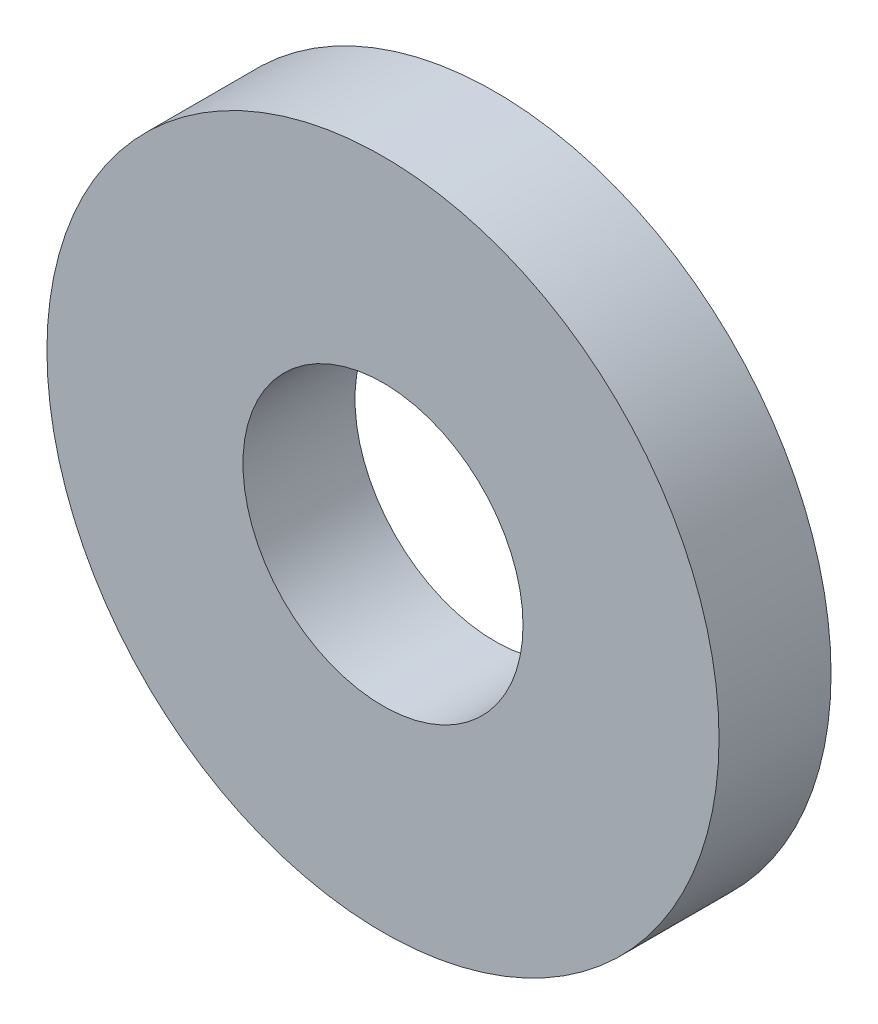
ISO-10303-21;
HEADER;
FILE_DESCRIPTION(('STEP AP214'),'2;1');
FILE_NAME('part.step','',(''),(''),'','','');
FILE_SCHEMA(('AUTOMOTIVE_DESIGN { 1 0 10303 214 1 1 1 1 }'));
ENDSEC;
DATA;
#1=APPLICATION_CONTEXT('core data for automotive mechanical design processes');
#2=APPLICATION_PROTOCOL_DEFINITION('international standard','automotive_design',2000,#1);
#3=PRODUCT_CONTEXT('',#1,'mechanical');
#4=PRODUCT('Part','Part','',(#3));
#5=PRODUCT_RELATED_PRODUCT_CATEGORY('part','',(#4));
#6=PRODUCT_DEFINITION_FORMATION('','',#4);
#7=PRODUCT_DEFINITION_CONTEXT('part definition',#1,'design');
#8=PRODUCT_DEFINITION('design','',#6,#7);
#9=PRODUCT_DEFINITION_SHAPE('','',#8);
#10=(LENGTH_UNIT() NAMED_UNIT(*) SI_UNIT(.MILLI.,.METRE.));
#11=(NAMED_UNIT(*) PLANE_ANGLE_UNIT() SI_UNIT($,.RADIAN.));
#12=(NAMED_UNIT(*) SI_UNIT($,.STERADIAN.) SOLID_ANGLE_UNIT());
#13=UNCERTAINTY_MEASURE_WITH_UNIT(LENGTH_MEASURE(1.E-05),#10,'distance_accuracy_value','');
#14=(GEOMETRIC_REPRESENTATION_CONTEXT(3) GLOBAL_UNCERTAINTY_ASSIGNED_CONTEXT((#13)) GLOBAL_UNIT_ASSIGNED_CONTEXT((#10,
#11,#12)) REPRESENTATION_CONTEXT('',''));
#15=CARTESIAN_POINT('',(0.,0.,0.));
#16=DIRECTION('',(0.,0.,1.));
#17=DIRECTION('',(1.,0.,0.));
#18=AXIS2_PLACEMENT_3D('',#15,#16,#17);
#19=CARTESIAN_POINT('',(-425.1,65.,-54.));
#20=DIRECTION('',(0.,0.,1.));
#21=DIRECTION('',(1.,0.,0.));
#22=AXIS2_PLACEMENT_3D('',#19,#20,#21);
#23=PLANE('',#22);
#24=CARTESIAN_POINT('',(-425.1,65.,-54.));
#25=DIRECTION('',(0.,0.,1.));
#26=DIRECTION('',(1.,0.,0.));
#27=AXIS2_PLACEMENT_3D('',#24,#25,#26);
#28=CIRCLE('',#27,5.);
#29=CARTESIAN_POINT('',(-420.1,65.,-54.));
#30=VERTEX_POINT('',#29);
#31=EDGE_CURVE('E58',#30,#30,#28,.T.);
#32=ORIENTED_EDGE('',*,*,#31,.T.);
#33=EDGE_LOOP('',(#32));
#34=FACE_BOUND('',#33,.T.);
#35=CARTESIAN_POINT('',(-425.1,65.,-54.));
#36=DIRECTION('',(0.,0.,1.));
#37=DIRECTION('',(1.,0.,0.));
#38=AXIS2_PLACEMENT_3D('',#35,#36,#37);
#39=CIRCLE('',#38,12.);
#40=CARTESIAN_POINT('',(-413.1,65.,-54.));
#41=VERTEX_POINT('',#40);
#42=EDGE_CURVE('E50',#41,#41,#39,.T.);
#43=ORIENTED_EDGE('',*,*,#42,.F.);
#44=EDGE_LOOP('',(#43));
#45=FACE_BOUND('',#44,.T.);
#46=ADVANCED_FACE('F44',(#34,#45),#23,.F.);
#47=CARTESIAN_POINT('',(-425.1,65.,-50.));
#48=DIRECTION('',(0.,0.,1.));
#49=DIRECTION('',(1.,0.,0.));
#50=AXIS2_PLACEMENT_3D('',#47,#48,#49);
#51=PLANE('',#50);
#52=CARTESIAN_POINT('',(-425.1,65.,-50.));
#53=DIRECTION('',(0.,0.,1.));
#54=DIRECTION('',(1.,0.,0.));
#55=AXIS2_PLACEMENT_3D('',#52,#53,#54);
#56=CIRCLE('',#55,5.);
#57=CARTESIAN_POINT('',(-420.1,65.,-50.));
#58=VERTEX_POINT('',#57);
#59=EDGE_CURVE('E54',#58,#58,#56,.T.);
#60=ORIENTED_EDGE('',*,*,#59,.F.);
#61=EDGE_LOOP('',(#60));
#62=FACE_BOUND('',#61,.T.);
#63=CARTESIAN_POINT('',(-425.1,65.,-50.));
#64=DIRECTION('',(0.,0.,1.));
#65=DIRECTION('',(1.,0.,0.));
#66=AXIS2_PLACEMENT_3D('',#63,#64,#65);
#67=CIRCLE('',#66,12.);
#68=CARTESIAN_POINT('',(-413.1,65.,-50.));
#69=VERTEX_POINT('',#68);
#70=EDGE_CURVE('E11',#69,#69,#67,.T.);
#71=ORIENTED_EDGE('',*,*,#70,.T.);
#72=EDGE_LOOP('',(#71));
#73=FACE_BOUND('',#72,.T.);
#74=ADVANCED_FACE('F74',(#62,#73),#51,.T.);
#75=CARTESIAN_POINT('',(-425.1,65.,-54.));
#76=DIRECTION('',(0.,0.,1.));
#77=DIRECTION('',(1.,0.,0.));
#78=AXIS2_PLACEMENT_3D('',#75,#76,#77);
#79=CYLINDRICAL_SURFACE('',#78,12.);
#80=ORIENTED_EDGE('',*,*,#70,.F.);
#81=EDGE_LOOP('',(#80));
#82=FACE_BOUND('',#81,.T.);
#83=ORIENTED_EDGE('',*,*,#42,.T.);
#84=EDGE_LOOP('',(#83));
#85=FACE_BOUND('',#84,.T.);
#86=ADVANCED_FACE('F68',(#82,#85),#79,.T.);
#87=CARTESIAN_POINT('',(-425.1,65.,-54.));
#88=DIRECTION('',(0.,0.,1.));
#89=DIRECTION('',(1.,0.,0.));
#90=AXIS2_PLACEMENT_3D('',#87,#88,#89);
#91=CYLINDRICAL_SURFACE('',#90,5.);
#92=ORIENTED_EDGE('',*,*,#59,.T.);
#93=EDGE_LOOP('',(#92));
#94=FACE_BOUND('',#93,.T.);
#95=ORIENTED_EDGE('',*,*,#31,.F.);
#96=EDGE_LOOP('',(#95));
#97=FACE_BOUND('',#96,.T.);
#98=ADVANCED_FACE('F66',(#94,#97),#91,.F.);
#99=CLOSED_SHELL('',(#46,#74,#86,#98));
#100=MANIFOLD_SOLID_BREP('B2',#99);
#101=ADVANCED_BREP_SHAPE_REPRESENTATION('',(#18,#100),#14);
#102=SHAPE_DEFINITION_REPRESENTATION(#9,#101);
ENDSEC;
END-ISO-10303-21;
